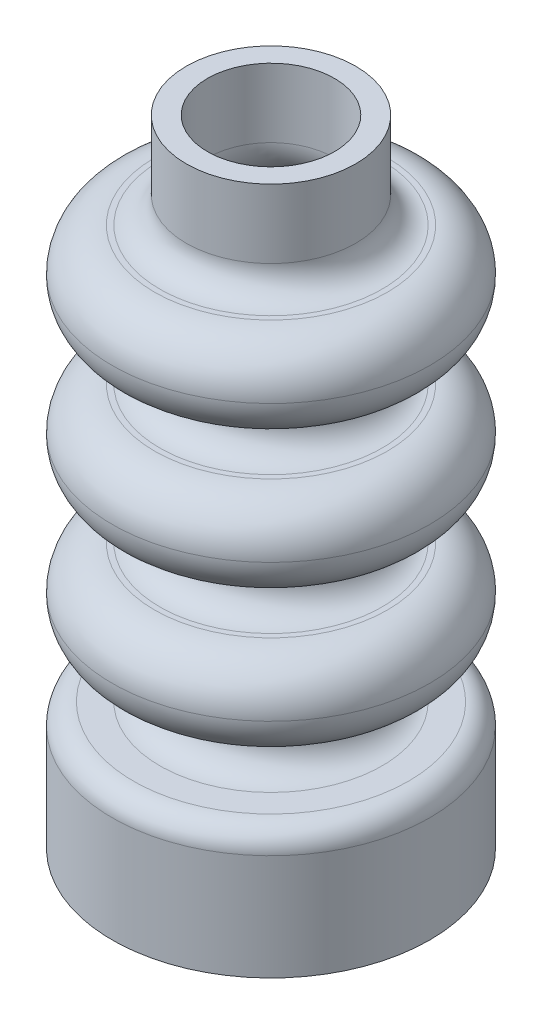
ISO-10303-21;
HEADER;
FILE_DESCRIPTION(('STEP AP214'),'2;1');
FILE_NAME('part.step','',(''),(''),'','','');
FILE_SCHEMA(('AUTOMOTIVE_DESIGN { 1 0 10303 214 1 1 1 1 }'));
ENDSEC;
DATA;
#1=APPLICATION_CONTEXT('core data for automotive mechanical design processes');
#2=APPLICATION_PROTOCOL_DEFINITION('international standard','automotive_design',2000,#1);
#3=PRODUCT_CONTEXT('',#1,'mechanical');
#4=PRODUCT('Part','Part','',(#3));
#5=PRODUCT_RELATED_PRODUCT_CATEGORY('part','',(#4));
#6=PRODUCT_DEFINITION_FORMATION('','',#4);
#7=PRODUCT_DEFINITION_CONTEXT('part definition',#1,'design');
#8=PRODUCT_DEFINITION('design','',#6,#7);
#9=PRODUCT_DEFINITION_SHAPE('','',#8);
#10=(LENGTH_UNIT() NAMED_UNIT(*) SI_UNIT(.MILLI.,.METRE.));
#11=(NAMED_UNIT(*) PLANE_ANGLE_UNIT() SI_UNIT($,.RADIAN.));
#12=(NAMED_UNIT(*) SI_UNIT($,.STERADIAN.) SOLID_ANGLE_UNIT());
#13=UNCERTAINTY_MEASURE_WITH_UNIT(LENGTH_MEASURE(1.E-05),#10,'distance_accuracy_value','');
#14=(GEOMETRIC_REPRESENTATION_CONTEXT(3) GLOBAL_UNCERTAINTY_ASSIGNED_CONTEXT((#13)) GLOBAL_UNIT_ASSIGNED_CONTEXT((#10,
#11,#12)) REPRESENTATION_CONTEXT('',''));
#15=CARTESIAN_POINT('',(0.,0.,0.));
#16=DIRECTION('',(0.,0.,1.));
#17=DIRECTION('',(1.,0.,0.));
#18=AXIS2_PLACEMENT_3D('',#15,#16,#17);
#19=CARTESIAN_POINT('',(0.,0.,0.));
#20=DIRECTION('',(0.,-1.,0.));
#21=DIRECTION('',(1.,0.,0.));
#22=AXIS2_PLACEMENT_3D('',#19,#20,#21);
#23=PLANE('',#22);
#24=CARTESIAN_POINT('',(0.,0.,0.));
#25=DIRECTION('',(0.,-1.,0.));
#26=DIRECTION('',(1.,0.,0.));
#27=AXIS2_PLACEMENT_3D('',#24,#25,#26);
#28=CIRCLE('',#27,3.25);
#29=CARTESIAN_POINT('',(3.25,0.,0.));
#30=VERTEX_POINT('',#29);
#31=EDGE_CURVE('E121',#30,#30,#28,.F.);
#32=ORIENTED_EDGE('',*,*,#31,.T.);
#33=EDGE_LOOP('',(#32));
#34=FACE_BOUND('',#33,.T.);
#35=CARTESIAN_POINT('',(0.,0.,0.));
#36=DIRECTION('',(0.,1.,0.));
#37=DIRECTION('',(-1.,0.,0.));
#38=AXIS2_PLACEMENT_3D('',#35,#36,#37);
#39=CIRCLE('',#38,3.75);
#40=CARTESIAN_POINT('',(-3.75,0.,0.));
#41=VERTEX_POINT('',#40);
#42=EDGE_CURVE('E113',#41,#41,#39,.T.);
#43=ORIENTED_EDGE('',*,*,#42,.F.);
#44=EDGE_LOOP('',(#43));
#45=FACE_BOUND('',#44,.T.);
#46=ADVANCED_FACE('F37',(#34,#45),#23,.T.);
#47=CARTESIAN_POINT('',(0.,15.,0.));
#48=DIRECTION('',(0.,1.,0.));
#49=DIRECTION('',(-1.,0.,0.));
#50=AXIS2_PLACEMENT_3D('',#47,#48,#49);
#51=CYLINDRICAL_SURFACE('',#50,3.75);
#52=CARTESIAN_POINT('',(0.,2.5,0.));
#53=DIRECTION('',(0.,1.,0.));
#54=DIRECTION('',(-1.,0.,0.));
#55=AXIS2_PLACEMENT_3D('',#52,#53,#54);
#56=CIRCLE('',#55,3.75);
#57=CARTESIAN_POINT('',(-3.75,2.5,0.));
#58=VERTEX_POINT('',#57);
#59=EDGE_CURVE('E10',#58,#58,#56,.F.);
#60=ORIENTED_EDGE('',*,*,#59,.T.);
#61=EDGE_LOOP('',(#60));
#62=FACE_BOUND('',#61,.T.);
#63=ORIENTED_EDGE('',*,*,#42,.T.);
#64=EDGE_LOOP('',(#63));
#65=FACE_BOUND('',#64,.T.);
#66=ADVANCED_FACE('F223',(#62,#65),#51,.T.);
#67=CARTESIAN_POINT('',(-3.75,3.,0.));
#68=DIRECTION('',(0.,1.,0.));
#69=DIRECTION('',(-1.,0.,0.));
#70=AXIS2_PLACEMENT_3D('',#67,#68,#69);
#71=PLANE('',#70);
#72=CARTESIAN_POINT('',(0.,3.,0.));
#73=DIRECTION('',(0.,1.,0.));
#74=DIRECTION('',(-1.,0.,0.));
#75=AXIS2_PLACEMENT_3D('',#72,#73,#74);
#76=CIRCLE('',#75,3.25);
#77=CARTESIAN_POINT('',(-3.25,3.,0.));
#78=VERTEX_POINT('',#77);
#79=EDGE_CURVE('E44',#78,#78,#76,.T.);
#80=ORIENTED_EDGE('',*,*,#79,.T.);
#81=EDGE_LOOP('',(#80));
#82=FACE_BOUND('',#81,.T.);
#83=CARTESIAN_POINT('',(0.,3.,0.));
#84=DIRECTION('',(0.,1.,0.));
#85=DIRECTION('',(-1.,0.,0.));
#86=AXIS2_PLACEMENT_3D('',#83,#84,#85);
#87=CIRCLE('',#86,2.625);
#88=CARTESIAN_POINT('',(-2.625,3.,0.));
#89=VERTEX_POINT('',#88);
#90=EDGE_CURVE('E107',#89,#89,#87,.F.);
#91=ORIENTED_EDGE('',*,*,#90,.T.);
#92=EDGE_LOOP('',(#91));
#93=FACE_BOUND('',#92,.T.);
#94=ADVANCED_FACE('F229',(#82,#93),#71,.T.);
#95=CARTESIAN_POINT('',(-2.,4.25,0.));
#96=DIRECTION('',(0.,-1.,0.));
#97=DIRECTION('',(1.,0.,0.));
#98=AXIS2_PLACEMENT_3D('',#95,#96,#97);
#99=PLANE('',#98);
#100=CARTESIAN_POINT('',(0.,4.25,0.));
#101=DIRECTION('',(0.,-1.,0.));
#102=DIRECTION('',(1.,0.,0.));
#103=AXIS2_PLACEMENT_3D('',#100,#101,#102);
#104=CIRCLE('',#103,2.75);
#105=CARTESIAN_POINT('',(2.75,4.25,0.));
#106=VERTEX_POINT('',#105);
#107=EDGE_CURVE('E48',#106,#106,#104,.T.);
#108=ORIENTED_EDGE('',*,*,#107,.T.);
#109=EDGE_LOOP('',(#108));
#110=FACE_BOUND('',#109,.T.);
#111=CARTESIAN_POINT('',(0.,4.25,0.));
#112=DIRECTION('',(0.,-1.,0.));
#113=DIRECTION('',(1.,0.,0.));
#114=AXIS2_PLACEMENT_3D('',#111,#112,#113);
#115=CIRCLE('',#114,2.625);
#116=CARTESIAN_POINT('',(2.625,4.25,0.));
#117=VERTEX_POINT('',#116);
#118=EDGE_CURVE('E110',#117,#117,#115,.F.);
#119=ORIENTED_EDGE('',*,*,#118,.T.);
#120=EDGE_LOOP('',(#119));
#121=FACE_BOUND('',#120,.T.);
#122=ADVANCED_FACE('F299',(#110,#121),#99,.T.);
#123=CARTESIAN_POINT('',(-3.74999999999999,6.25,0.));
#124=DIRECTION('',(0.,1.,0.));
#125=DIRECTION('',(-1.,0.,0.));
#126=AXIS2_PLACEMENT_3D('',#123,#124,#125);
#127=PLANE('',#126);
#128=CARTESIAN_POINT('',(0.,6.25,0.));
#129=DIRECTION('',(0.,1.,0.));
#130=DIRECTION('',(-1.,0.,0.));
#131=AXIS2_PLACEMENT_3D('',#128,#129,#130);
#132=CIRCLE('',#131,2.75);
#133=CARTESIAN_POINT('',(-2.75,6.25,0.));
#134=VERTEX_POINT('',#133);
#135=EDGE_CURVE('E65',#134,#134,#132,.T.);
#136=ORIENTED_EDGE('',*,*,#135,.T.);
#137=EDGE_LOOP('',(#136));
#138=FACE_BOUND('',#137,.T.);
#139=CARTESIAN_POINT('',(0.,6.25,0.));
#140=DIRECTION('',(0.,1.,0.));
#141=DIRECTION('',(-1.,0.,0.));
#142=AXIS2_PLACEMENT_3D('',#139,#140,#141);
#143=CIRCLE('',#142,2.625);
#144=CARTESIAN_POINT('',(-2.625,6.25,0.));
#145=VERTEX_POINT('',#144);
#146=EDGE_CURVE('E101',#145,#145,#143,.F.);
#147=ORIENTED_EDGE('',*,*,#146,.T.);
#148=EDGE_LOOP('',(#147));
#149=FACE_BOUND('',#148,.T.);
#150=ADVANCED_FACE('F295',(#138,#149),#127,.T.);
#151=CARTESIAN_POINT('',(-2.,7.5,0.));
#152=DIRECTION('',(0.,-1.,0.));
#153=DIRECTION('',(1.,0.,0.));
#154=AXIS2_PLACEMENT_3D('',#151,#152,#153);
#155=PLANE('',#154);
#156=CARTESIAN_POINT('',(0.,7.5,0.));
#157=DIRECTION('',(0.,-1.,0.));
#158=DIRECTION('',(1.,0.,0.));
#159=AXIS2_PLACEMENT_3D('',#156,#157,#158);
#160=CIRCLE('',#159,2.75);
#161=CARTESIAN_POINT('',(2.75,7.5,0.));
#162=VERTEX_POINT('',#161);
#163=EDGE_CURVE('E74',#162,#162,#160,.T.);
#164=ORIENTED_EDGE('',*,*,#163,.T.);
#165=EDGE_LOOP('',(#164));
#166=FACE_BOUND('',#165,.T.);
#167=CARTESIAN_POINT('',(0.,7.5,0.));
#168=DIRECTION('',(0.,-1.,0.));
#169=DIRECTION('',(1.,0.,0.));
#170=AXIS2_PLACEMENT_3D('',#167,#168,#169);
#171=CIRCLE('',#170,2.625);
#172=CARTESIAN_POINT('',(2.625,7.5,0.));
#173=VERTEX_POINT('',#172);
#174=EDGE_CURVE('E104',#173,#173,#171,.F.);
#175=ORIENTED_EDGE('',*,*,#174,.T.);
#176=EDGE_LOOP('',(#175));
#177=FACE_BOUND('',#176,.T.);
#178=ADVANCED_FACE('F298',(#166,#177),#155,.T.);
#179=CARTESIAN_POINT('',(-3.75,9.5,0.));
#180=DIRECTION('',(0.,1.,0.));
#181=DIRECTION('',(-1.,0.,0.));
#182=AXIS2_PLACEMENT_3D('',#179,#180,#181);
#183=PLANE('',#182);
#184=CARTESIAN_POINT('',(0.,9.5,0.));
#185=DIRECTION('',(0.,1.,0.));
#186=DIRECTION('',(-1.,0.,0.));
#187=AXIS2_PLACEMENT_3D('',#184,#185,#186);
#188=CIRCLE('',#187,2.75);
#189=CARTESIAN_POINT('',(-2.75,9.5,0.));
#190=VERTEX_POINT('',#189);
#191=EDGE_CURVE('E77',#190,#190,#188,.T.);
#192=ORIENTED_EDGE('',*,*,#191,.T.);
#193=EDGE_LOOP('',(#192));
#194=FACE_BOUND('',#193,.T.);
#195=CARTESIAN_POINT('',(0.,9.5,0.));
#196=DIRECTION('',(0.,1.,0.));
#197=DIRECTION('',(-1.,0.,0.));
#198=AXIS2_PLACEMENT_3D('',#195,#196,#197);
#199=CIRCLE('',#198,2.625);
#200=CARTESIAN_POINT('',(-2.625,9.5,0.));
#201=VERTEX_POINT('',#200);
#202=EDGE_CURVE('E95',#201,#201,#199,.F.);
#203=ORIENTED_EDGE('',*,*,#202,.T.);
#204=EDGE_LOOP('',(#203));
#205=FACE_BOUND('',#204,.T.);
#206=ADVANCED_FACE('F308',(#194,#205),#183,.T.);
#207=CARTESIAN_POINT('',(-2.,10.75,0.));
#208=DIRECTION('',(0.,-1.,0.));
#209=DIRECTION('',(1.,0.,0.));
#210=AXIS2_PLACEMENT_3D('',#207,#208,#209);
#211=PLANE('',#210);
#212=CARTESIAN_POINT('',(0.,10.75,0.));
#213=DIRECTION('',(0.,-1.,0.));
#214=DIRECTION('',(1.,0.,0.));
#215=AXIS2_PLACEMENT_3D('',#212,#213,#214);
#216=CIRCLE('',#215,2.75);
#217=CARTESIAN_POINT('',(2.75,10.75,0.));
#218=VERTEX_POINT('',#217);
#219=EDGE_CURVE('E68',#218,#218,#216,.T.);
#220=ORIENTED_EDGE('',*,*,#219,.T.);
#221=EDGE_LOOP('',(#220));
#222=FACE_BOUND('',#221,.T.);
#223=CARTESIAN_POINT('',(0.,10.75,0.));
#224=DIRECTION('',(0.,-1.,0.));
#225=DIRECTION('',(1.,0.,0.));
#226=AXIS2_PLACEMENT_3D('',#223,#224,#225);
#227=CIRCLE('',#226,2.625);
#228=CARTESIAN_POINT('',(2.625,10.75,0.));
#229=VERTEX_POINT('',#228);
#230=EDGE_CURVE('E98',#229,#229,#227,.F.);
#231=ORIENTED_EDGE('',*,*,#230,.T.);
#232=EDGE_LOOP('',(#231));
#233=FACE_BOUND('',#232,.T.);
#234=ADVANCED_FACE('F314',(#222,#233),#211,.T.);
#235=CARTESIAN_POINT('',(-3.75,12.75,0.));
#236=DIRECTION('',(0.,1.,0.));
#237=DIRECTION('',(-1.,0.,0.));
#238=AXIS2_PLACEMENT_3D('',#235,#236,#237);
#239=PLANE('',#238);
#240=CARTESIAN_POINT('',(0.,12.75,0.));
#241=DIRECTION('',(0.,1.,0.));
#242=DIRECTION('',(-1.,0.,0.));
#243=AXIS2_PLACEMENT_3D('',#240,#241,#242);
#244=CIRCLE('',#243,2.75);
#245=CARTESIAN_POINT('',(-2.75,12.75,0.));
#246=VERTEX_POINT('',#245);
#247=EDGE_CURVE('E71',#246,#246,#244,.T.);
#248=ORIENTED_EDGE('',*,*,#247,.T.);
#249=EDGE_LOOP('',(#248));
#250=FACE_BOUND('',#249,.T.);
#251=CARTESIAN_POINT('',(0.,12.75,0.));
#252=DIRECTION('',(0.,1.,0.));
#253=DIRECTION('',(-1.,0.,0.));
#254=AXIS2_PLACEMENT_3D('',#251,#252,#253);
#255=CIRCLE('',#254,2.625);
#256=CARTESIAN_POINT('',(-2.625,12.75,0.));
#257=VERTEX_POINT('',#256);
#258=EDGE_CURVE('E80',#257,#257,#255,.F.);
#259=ORIENTED_EDGE('',*,*,#258,.T.);
#260=EDGE_LOOP('',(#259));
#261=FACE_BOUND('',#260,.T.);
#262=ADVANCED_FACE('F366',(#250,#261),#239,.T.);
#263=CARTESIAN_POINT('',(0.,15.,0.));
#264=DIRECTION('',(0.,1.,0.));
#265=DIRECTION('',(-1.,0.,0.));
#266=AXIS2_PLACEMENT_3D('',#263,#264,#265);
#267=CYLINDRICAL_SURFACE('',#266,2.);
#268=CARTESIAN_POINT('',(0.,13.375,0.));
#269=DIRECTION('',(0.,1.,0.));
#270=DIRECTION('',(-1.,0.,0.));
#271=AXIS2_PLACEMENT_3D('',#268,#269,#270);
#272=CIRCLE('',#271,2.);
#273=CARTESIAN_POINT('',(-2.,13.375,0.));
#274=VERTEX_POINT('',#273);
#275=EDGE_CURVE('E92',#274,#274,#272,.T.);
#276=ORIENTED_EDGE('',*,*,#275,.T.);
#277=EDGE_LOOP('',(#276));
#278=FACE_BOUND('',#277,.T.);
#279=CARTESIAN_POINT('',(0.,15.,0.));
#280=DIRECTION('',(0.,1.,0.));
#281=DIRECTION('',(-1.,0.,0.));
#282=AXIS2_PLACEMENT_3D('',#279,#280,#281);
#283=CIRCLE('',#282,2.);
#284=CARTESIAN_POINT('',(-2.,15.,0.));
#285=VERTEX_POINT('',#284);
#286=EDGE_CURVE('E89',#285,#285,#283,.T.);
#287=ORIENTED_EDGE('',*,*,#286,.F.);
#288=EDGE_LOOP('',(#287));
#289=FACE_BOUND('',#288,.T.);
#290=ADVANCED_FACE('F375',(#278,#289),#267,.T.);
#291=CARTESIAN_POINT('',(-2.,15.,0.));
#292=DIRECTION('',(0.,1.,0.));
#293=DIRECTION('',(-1.,0.,0.));
#294=AXIS2_PLACEMENT_3D('',#291,#292,#293);
#295=PLANE('',#294);
#296=CARTESIAN_POINT('',(0.,15.,0.));
#297=DIRECTION('',(0.,1.,0.));
#298=DIRECTION('',(-1.,0.,0.));
#299=AXIS2_PLACEMENT_3D('',#296,#297,#298);
#300=CIRCLE('',#299,1.5);
#301=CARTESIAN_POINT('',(-1.5,15.,0.));
#302=VERTEX_POINT('',#301);
#303=EDGE_CURVE('E118',#302,#302,#300,.T.);
#304=ORIENTED_EDGE('',*,*,#303,.F.);
#305=EDGE_LOOP('',(#304));
#306=FACE_BOUND('',#305,.T.);
#307=ORIENTED_EDGE('',*,*,#286,.T.);
#308=EDGE_LOOP('',(#307));
#309=FACE_BOUND('',#308,.T.);
#310=ADVANCED_FACE('F242',(#306,#309),#295,.T.);
#311=CARTESIAN_POINT('',(0.,3.625,0.));
#312=DIRECTION('',(0.,1.,0.));
#313=DIRECTION('',(-1.,0.,0.));
#314=AXIS2_PLACEMENT_3D('',#311,#312,#313);
#315=TOROIDAL_SURFACE('',#314,2.625,0.625);
#316=ORIENTED_EDGE('',*,*,#90,.F.);
#317=EDGE_LOOP('',(#316));
#318=FACE_BOUND('',#317,.T.);
#319=CARTESIAN_POINT('',(0.,3.625,0.));
#320=DIRECTION('',(0.,1.,0.));
#321=DIRECTION('',(-1.,0.,0.));
#322=AXIS2_PLACEMENT_3D('',#319,#320,#321);
#323=CIRCLE('',#322,2.);
#324=CARTESIAN_POINT('',(-2.,3.625,0.));
#325=VERTEX_POINT('',#324);
#326=EDGE_CURVE('E86',#325,#325,#323,.T.);
#327=ORIENTED_EDGE('',*,*,#326,.F.);
#328=EDGE_LOOP('',(#327));
#329=FACE_BOUND('',#328,.T.);
#330=ADVANCED_FACE('F238',(#318,#329),#315,.F.);
#331=CARTESIAN_POINT('',(0.,3.625,0.));
#332=DIRECTION('',(0.,-1.,0.));
#333=DIRECTION('',(1.,0.,0.));
#334=AXIS2_PLACEMENT_3D('',#331,#332,#333);
#335=TOROIDAL_SURFACE('',#334,2.625,0.625);
#336=ORIENTED_EDGE('',*,*,#326,.T.);
#337=EDGE_LOOP('',(#336));
#338=FACE_BOUND('',#337,.T.);
#339=ORIENTED_EDGE('',*,*,#118,.F.);
#340=EDGE_LOOP('',(#339));
#341=FACE_BOUND('',#340,.T.);
#342=ADVANCED_FACE('F234',(#338,#341),#335,.F.);
#343=CARTESIAN_POINT('',(0.,6.875,0.));
#344=DIRECTION('',(0.,1.,0.));
#345=DIRECTION('',(-1.,0.,0.));
#346=AXIS2_PLACEMENT_3D('',#343,#344,#345);
#347=TOROIDAL_SURFACE('',#346,2.625,0.625);
#348=ORIENTED_EDGE('',*,*,#146,.F.);
#349=EDGE_LOOP('',(#348));
#350=FACE_BOUND('',#349,.T.);
#351=CARTESIAN_POINT('',(0.,6.875,0.));
#352=DIRECTION('',(0.,1.,0.));
#353=DIRECTION('',(-1.,0.,0.));
#354=AXIS2_PLACEMENT_3D('',#351,#352,#353);
#355=CIRCLE('',#354,2.);
#356=CARTESIAN_POINT('',(-2.,6.875,0.));
#357=VERTEX_POINT('',#356);
#358=EDGE_CURVE('E83',#357,#357,#355,.T.);
#359=ORIENTED_EDGE('',*,*,#358,.F.);
#360=EDGE_LOOP('',(#359));
#361=FACE_BOUND('',#360,.T.);
#362=ADVANCED_FACE('F237',(#350,#361),#347,.F.);
#363=CARTESIAN_POINT('',(0.,6.875,0.));
#364=DIRECTION('',(0.,-1.,0.));
#365=DIRECTION('',(1.,0.,0.));
#366=AXIS2_PLACEMENT_3D('',#363,#364,#365);
#367=TOROIDAL_SURFACE('',#366,2.625,0.625);
#368=ORIENTED_EDGE('',*,*,#358,.T.);
#369=EDGE_LOOP('',(#368));
#370=FACE_BOUND('',#369,.T.);
#371=ORIENTED_EDGE('',*,*,#174,.F.);
#372=EDGE_LOOP('',(#371));
#373=FACE_BOUND('',#372,.T.);
#374=ADVANCED_FACE('F244',(#370,#373),#367,.F.);
#375=CARTESIAN_POINT('',(0.,10.125,0.));
#376=DIRECTION('',(0.,1.,0.));
#377=DIRECTION('',(-1.,0.,0.));
#378=AXIS2_PLACEMENT_3D('',#375,#376,#377);
#379=TOROIDAL_SURFACE('',#378,2.625,0.625);
#380=ORIENTED_EDGE('',*,*,#202,.F.);
#381=EDGE_LOOP('',(#380));
#382=FACE_BOUND('',#381,.T.);
#383=CARTESIAN_POINT('',(0.,10.125,0.));
#384=DIRECTION('',(0.,1.,0.));
#385=DIRECTION('',(-1.,0.,0.));
#386=AXIS2_PLACEMENT_3D('',#383,#384,#385);
#387=CIRCLE('',#386,2.);
#388=CARTESIAN_POINT('',(-2.,10.125,0.));
#389=VERTEX_POINT('',#388);
#390=EDGE_CURVE('E62',#389,#389,#387,.T.);
#391=ORIENTED_EDGE('',*,*,#390,.F.);
#392=EDGE_LOOP('',(#391));
#393=FACE_BOUND('',#392,.T.);
#394=ADVANCED_FACE('F247',(#382,#393),#379,.F.);
#395=CARTESIAN_POINT('',(0.,10.125,0.));
#396=DIRECTION('',(0.,-1.,0.));
#397=DIRECTION('',(1.,0.,0.));
#398=AXIS2_PLACEMENT_3D('',#395,#396,#397);
#399=TOROIDAL_SURFACE('',#398,2.625,0.625);
#400=ORIENTED_EDGE('',*,*,#390,.T.);
#401=EDGE_LOOP('',(#400));
#402=FACE_BOUND('',#401,.T.);
#403=ORIENTED_EDGE('',*,*,#230,.F.);
#404=EDGE_LOOP('',(#403));
#405=FACE_BOUND('',#404,.T.);
#406=ADVANCED_FACE('F252',(#402,#405),#399,.F.);
#407=CARTESIAN_POINT('',(0.,13.375,0.));
#408=DIRECTION('',(0.,1.,0.));
#409=DIRECTION('',(-1.,0.,0.));
#410=AXIS2_PLACEMENT_3D('',#407,#408,#409);
#411=TOROIDAL_SURFACE('',#410,2.625,0.625);
#412=ORIENTED_EDGE('',*,*,#258,.F.);
#413=EDGE_LOOP('',(#412));
#414=FACE_BOUND('',#413,.T.);
#415=ORIENTED_EDGE('',*,*,#275,.F.);
#416=EDGE_LOOP('',(#415));
#417=FACE_BOUND('',#416,.T.);
#418=ADVANCED_FACE('F255',(#414,#417),#411,.F.);
#419=CARTESIAN_POINT('',(0.,8.5,0.));
#420=DIRECTION('',(0.,-1.,0.));
#421=DIRECTION('',(1.,0.,0.));
#422=AXIS2_PLACEMENT_3D('',#419,#420,#421);
#423=TOROIDAL_SURFACE('',#422,2.75,1.);
#424=ORIENTED_EDGE('',*,*,#163,.F.);
#425=EDGE_LOOP('',(#424));
#426=FACE_BOUND('',#425,.T.);
#427=CARTESIAN_POINT('',(0.,8.5,0.));
#428=DIRECTION('',(0.,-1.,0.));
#429=DIRECTION('',(1.,0.,0.));
#430=AXIS2_PLACEMENT_3D('',#427,#428,#429);
#431=CIRCLE('',#430,3.75);
#432=CARTESIAN_POINT('',(3.75,8.5,0.));
#433=VERTEX_POINT('',#432);
#434=EDGE_CURVE('E58',#433,#433,#431,.F.);
#435=ORIENTED_EDGE('',*,*,#434,.F.);
#436=EDGE_LOOP('',(#435));
#437=FACE_BOUND('',#436,.T.);
#438=ADVANCED_FACE('F262',(#426,#437),#423,.T.);
#439=CARTESIAN_POINT('',(0.,8.5,0.));
#440=DIRECTION('',(0.,1.,0.));
#441=DIRECTION('',(-1.,0.,0.));
#442=AXIS2_PLACEMENT_3D('',#439,#440,#441);
#443=TOROIDAL_SURFACE('',#442,2.75,1.);
#444=ORIENTED_EDGE('',*,*,#434,.T.);
#445=EDGE_LOOP('',(#444));
#446=FACE_BOUND('',#445,.T.);
#447=ORIENTED_EDGE('',*,*,#191,.F.);
#448=EDGE_LOOP('',(#447));
#449=FACE_BOUND('',#448,.T.);
#450=ADVANCED_FACE('F264',(#446,#449),#443,.T.);
#451=CARTESIAN_POINT('',(0.,11.75,0.));
#452=DIRECTION('',(0.,-1.,0.));
#453=DIRECTION('',(1.,0.,0.));
#454=AXIS2_PLACEMENT_3D('',#451,#452,#453);
#455=TOROIDAL_SURFACE('',#454,2.75,1.);
#456=ORIENTED_EDGE('',*,*,#219,.F.);
#457=EDGE_LOOP('',(#456));
#458=FACE_BOUND('',#457,.T.);
#459=CARTESIAN_POINT('',(0.,11.75,0.));
#460=DIRECTION('',(0.,-1.,0.));
#461=DIRECTION('',(1.,0.,0.));
#462=AXIS2_PLACEMENT_3D('',#459,#460,#461);
#463=CIRCLE('',#462,3.75);
#464=CARTESIAN_POINT('',(3.75,11.75,0.));
#465=VERTEX_POINT('',#464);
#466=EDGE_CURVE('E55',#465,#465,#463,.F.);
#467=ORIENTED_EDGE('',*,*,#466,.F.);
#468=EDGE_LOOP('',(#467));
#469=FACE_BOUND('',#468,.T.);
#470=ADVANCED_FACE('F267',(#458,#469),#455,.T.);
#471=CARTESIAN_POINT('',(0.,11.75,0.));
#472=DIRECTION('',(0.,1.,0.));
#473=DIRECTION('',(-1.,0.,0.));
#474=AXIS2_PLACEMENT_3D('',#471,#472,#473);
#475=TOROIDAL_SURFACE('',#474,2.75,1.);
#476=ORIENTED_EDGE('',*,*,#466,.T.);
#477=EDGE_LOOP('',(#476));
#478=FACE_BOUND('',#477,.T.);
#479=ORIENTED_EDGE('',*,*,#247,.F.);
#480=EDGE_LOOP('',(#479));
#481=FACE_BOUND('',#480,.T.);
#482=ADVANCED_FACE('F272',(#478,#481),#475,.T.);
#483=CARTESIAN_POINT('',(0.,5.25,0.));
#484=DIRECTION('',(0.,1.,0.));
#485=DIRECTION('',(-1.,0.,0.));
#486=AXIS2_PLACEMENT_3D('',#483,#484,#485);
#487=TOROIDAL_SURFACE('',#486,2.75,1.);
#488=CARTESIAN_POINT('',(0.,5.25,0.));
#489=DIRECTION('',(0.,1.,0.));
#490=DIRECTION('',(-1.,0.,0.));
#491=AXIS2_PLACEMENT_3D('',#488,#489,#490);
#492=CIRCLE('',#491,3.75);
#493=CARTESIAN_POINT('',(-3.75,5.25,0.));
#494=VERTEX_POINT('',#493);
#495=EDGE_CURVE('E52',#494,#494,#492,.F.);
#496=ORIENTED_EDGE('',*,*,#495,.F.);
#497=EDGE_LOOP('',(#496));
#498=FACE_BOUND('',#497,.T.);
#499=ORIENTED_EDGE('',*,*,#135,.F.);
#500=EDGE_LOOP('',(#499));
#501=FACE_BOUND('',#500,.T.);
#502=ADVANCED_FACE('F275',(#498,#501),#487,.T.);
#503=CARTESIAN_POINT('',(0.,5.25,0.));
#504=DIRECTION('',(0.,-1.,0.));
#505=DIRECTION('',(1.,0.,0.));
#506=AXIS2_PLACEMENT_3D('',#503,#504,#505);
#507=TOROIDAL_SURFACE('',#506,2.75,1.);
#508=ORIENTED_EDGE('',*,*,#107,.F.);
#509=EDGE_LOOP('',(#508));
#510=FACE_BOUND('',#509,.T.);
#511=ORIENTED_EDGE('',*,*,#495,.T.);
#512=EDGE_LOOP('',(#511));
#513=FACE_BOUND('',#512,.T.);
#514=ADVANCED_FACE('F281',(#510,#513),#507,.T.);
#515=CARTESIAN_POINT('',(0.,2.5,0.));
#516=DIRECTION('',(0.,1.,0.));
#517=DIRECTION('',(-1.,0.,0.));
#518=AXIS2_PLACEMENT_3D('',#515,#516,#517);
#519=TOROIDAL_SURFACE('',#518,3.25,0.5);
#520=ORIENTED_EDGE('',*,*,#59,.F.);
#521=EDGE_LOOP('',(#520));
#522=FACE_BOUND('',#521,.T.);
#523=ORIENTED_EDGE('',*,*,#79,.F.);
#524=EDGE_LOOP('',(#523));
#525=FACE_BOUND('',#524,.T.);
#526=ADVANCED_FACE('F39',(#522,#525),#519,.T.);
#527=CARTESIAN_POINT('',(0.,15.,0.));
#528=DIRECTION('',(0.,1.,0.));
#529=DIRECTION('',(-1.,0.,0.));
#530=AXIS2_PLACEMENT_3D('',#527,#528,#529);
#531=CYLINDRICAL_SURFACE('',#530,3.25);
#532=CARTESIAN_POINT('',(0.,2.5,0.));
#533=DIRECTION('',(0.,1.,0.));
#534=DIRECTION('',(-1.,0.,0.));
#535=AXIS2_PLACEMENT_3D('',#532,#533,#534);
#536=CIRCLE('',#535,3.25);
#537=CARTESIAN_POINT('',(-3.25,2.5,0.));
#538=VERTEX_POINT('',#537);
#539=EDGE_CURVE('E59',#538,#538,#536,.T.);
#540=ORIENTED_EDGE('',*,*,#539,.T.);
#541=EDGE_LOOP('',(#540));
#542=FACE_BOUND('',#541,.T.);
#543=ORIENTED_EDGE('',*,*,#31,.F.);
#544=EDGE_LOOP('',(#543));
#545=FACE_BOUND('',#544,.T.);
#546=ADVANCED_FACE('F187',(#542,#545),#531,.F.);
#547=CARTESIAN_POINT('',(-3.75,2.5,0.));
#548=DIRECTION('',(0.,1.,0.));
#549=DIRECTION('',(-1.,0.,0.));
#550=AXIS2_PLACEMENT_3D('',#547,#548,#549);
#551=PLANE('',#550);
#552=ORIENTED_EDGE('',*,*,#539,.F.);
#553=EDGE_LOOP('',(#552));
#554=FACE_BOUND('',#553,.T.);
#555=CARTESIAN_POINT('',(0.,2.5,0.));
#556=DIRECTION('',(0.,1.,0.));
#557=DIRECTION('',(-1.,0.,0.));
#558=AXIS2_PLACEMENT_3D('',#555,#556,#557);
#559=CIRCLE('',#558,2.625);
#560=CARTESIAN_POINT('',(-2.625,2.5,0.));
#561=VERTEX_POINT('',#560);
#562=EDGE_CURVE('E165',#561,#561,#559,.F.);
#563=ORIENTED_EDGE('',*,*,#562,.F.);
#564=EDGE_LOOP('',(#563));
#565=FACE_BOUND('',#564,.T.);
#566=ADVANCED_FACE('F190',(#554,#565),#551,.F.);
#567=CARTESIAN_POINT('',(-2.,4.75,0.));
#568=DIRECTION('',(0.,-1.,0.));
#569=DIRECTION('',(1.,0.,0.));
#570=AXIS2_PLACEMENT_3D('',#567,#568,#569);
#571=PLANE('',#570);
#572=CARTESIAN_POINT('',(0.,4.75,0.));
#573=DIRECTION('',(0.,-1.,0.));
#574=DIRECTION('',(1.,0.,0.));
#575=AXIS2_PLACEMENT_3D('',#572,#573,#574);
#576=CIRCLE('',#575,2.75);
#577=CARTESIAN_POINT('',(2.75,4.75,0.));
#578=VERTEX_POINT('',#577);
#579=EDGE_CURVE('E175',#578,#578,#576,.T.);
#580=ORIENTED_EDGE('',*,*,#579,.F.);
#581=EDGE_LOOP('',(#580));
#582=FACE_BOUND('',#581,.T.);
#583=CARTESIAN_POINT('',(0.,4.75,0.));
#584=DIRECTION('',(0.,-1.,0.));
#585=DIRECTION('',(1.,0.,0.));
#586=AXIS2_PLACEMENT_3D('',#583,#584,#585);
#587=CIRCLE('',#586,2.625);
#588=CARTESIAN_POINT('',(2.625,4.75,0.));
#589=VERTEX_POINT('',#588);
#590=EDGE_CURVE('E125',#589,#589,#587,.F.);
#591=ORIENTED_EDGE('',*,*,#590,.F.);
#592=EDGE_LOOP('',(#591));
#593=FACE_BOUND('',#592,.T.);
#594=ADVANCED_FACE('F193',(#582,#593),#571,.F.);
#595=CARTESIAN_POINT('',(-3.74999999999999,5.75,0.));
#596=DIRECTION('',(0.,1.,0.));
#597=DIRECTION('',(-1.,0.,0.));
#598=AXIS2_PLACEMENT_3D('',#595,#596,#597);
#599=PLANE('',#598);
#600=CARTESIAN_POINT('',(0.,5.75,0.));
#601=DIRECTION('',(0.,1.,0.));
#602=DIRECTION('',(-1.,0.,0.));
#603=AXIS2_PLACEMENT_3D('',#600,#601,#602);
#604=CIRCLE('',#603,2.75);
#605=CARTESIAN_POINT('',(-2.75,5.75,0.));
#606=VERTEX_POINT('',#605);
#607=EDGE_CURVE('E145',#606,#606,#604,.T.);
#608=ORIENTED_EDGE('',*,*,#607,.F.);
#609=EDGE_LOOP('',(#608));
#610=FACE_BOUND('',#609,.T.);
#611=CARTESIAN_POINT('',(0.,5.75,0.));
#612=DIRECTION('',(0.,1.,0.));
#613=DIRECTION('',(-1.,0.,0.));
#614=AXIS2_PLACEMENT_3D('',#611,#612,#613);
#615=CIRCLE('',#614,2.625);
#616=CARTESIAN_POINT('',(-2.625,5.75,0.));
#617=VERTEX_POINT('',#616);
#618=EDGE_CURVE('E149',#617,#617,#615,.F.);
#619=ORIENTED_EDGE('',*,*,#618,.F.);
#620=EDGE_LOOP('',(#619));
#621=FACE_BOUND('',#620,.T.);
#622=ADVANCED_FACE('F212',(#610,#621),#599,.F.);
#623=CARTESIAN_POINT('',(-2.,8.,0.));
#624=DIRECTION('',(0.,-1.,0.));
#625=DIRECTION('',(1.,0.,0.));
#626=AXIS2_PLACEMENT_3D('',#623,#624,#625);
#627=PLANE('',#626);
#628=CARTESIAN_POINT('',(0.,8.,0.));
#629=DIRECTION('',(0.,-1.,0.));
#630=DIRECTION('',(1.,0.,0.));
#631=AXIS2_PLACEMENT_3D('',#628,#629,#630);
#632=CIRCLE('',#631,2.75);
#633=CARTESIAN_POINT('',(2.75,8.,0.));
#634=VERTEX_POINT('',#633);
#635=EDGE_CURVE('E138',#634,#634,#632,.T.);
#636=ORIENTED_EDGE('',*,*,#635,.F.);
#637=EDGE_LOOP('',(#636));
#638=FACE_BOUND('',#637,.T.);
#639=CARTESIAN_POINT('',(0.,8.,0.));
#640=DIRECTION('',(0.,-1.,0.));
#641=DIRECTION('',(1.,0.,0.));
#642=AXIS2_PLACEMENT_3D('',#639,#640,#641);
#643=CIRCLE('',#642,2.625);
#644=CARTESIAN_POINT('',(2.625,8.,0.));
#645=VERTEX_POINT('',#644);
#646=EDGE_CURVE('E162',#645,#645,#643,.F.);
#647=ORIENTED_EDGE('',*,*,#646,.F.);
#648=EDGE_LOOP('',(#647));
#649=FACE_BOUND('',#648,.T.);
#650=ADVANCED_FACE('F218',(#638,#649),#627,.F.);
#651=CARTESIAN_POINT('',(-3.75,9.,0.));
#652=DIRECTION('',(0.,1.,0.));
#653=DIRECTION('',(-1.,0.,0.));
#654=AXIS2_PLACEMENT_3D('',#651,#652,#653);
#655=PLANE('',#654);
#656=CARTESIAN_POINT('',(0.,9.,0.));
#657=DIRECTION('',(0.,1.,0.));
#658=DIRECTION('',(-1.,0.,0.));
#659=AXIS2_PLACEMENT_3D('',#656,#657,#658);
#660=CIRCLE('',#659,2.75);
#661=CARTESIAN_POINT('',(-2.75,9.,0.));
#662=VERTEX_POINT('',#661);
#663=EDGE_CURVE('E133',#662,#662,#660,.T.);
#664=ORIENTED_EDGE('',*,*,#663,.F.);
#665=EDGE_LOOP('',(#664));
#666=FACE_BOUND('',#665,.T.);
#667=CARTESIAN_POINT('',(0.,9.,0.));
#668=DIRECTION('',(0.,1.,0.));
#669=DIRECTION('',(-1.,0.,0.));
#670=AXIS2_PLACEMENT_3D('',#667,#668,#669);
#671=CIRCLE('',#670,2.625);
#672=CARTESIAN_POINT('',(-2.625,9.,0.));
#673=VERTEX_POINT('',#672);
#674=EDGE_CURVE('E130',#673,#673,#671,.F.);
#675=ORIENTED_EDGE('',*,*,#674,.F.);
#676=EDGE_LOOP('',(#675));
#677=FACE_BOUND('',#676,.T.);
#678=ADVANCED_FACE('F448',(#666,#677),#655,.F.);
#679=CARTESIAN_POINT('',(-2.,11.25,0.));
#680=DIRECTION('',(0.,-1.,0.));
#681=DIRECTION('',(1.,0.,0.));
#682=AXIS2_PLACEMENT_3D('',#679,#680,#681);
#683=PLANE('',#682);
#684=CARTESIAN_POINT('',(0.,11.25,0.));
#685=DIRECTION('',(0.,-1.,0.));
#686=DIRECTION('',(1.,0.,0.));
#687=AXIS2_PLACEMENT_3D('',#684,#685,#686);
#688=CIRCLE('',#687,2.75);
#689=CARTESIAN_POINT('',(2.75,11.25,0.));
#690=VERTEX_POINT('',#689);
#691=EDGE_CURVE('E137',#690,#690,#688,.T.);
#692=ORIENTED_EDGE('',*,*,#691,.F.);
#693=EDGE_LOOP('',(#692));
#694=FACE_BOUND('',#693,.T.);
#695=CARTESIAN_POINT('',(0.,11.25,0.));
#696=DIRECTION('',(0.,-1.,0.));
#697=DIRECTION('',(1.,0.,0.));
#698=AXIS2_PLACEMENT_3D('',#695,#696,#697);
#699=CIRCLE('',#698,2.625);
#700=CARTESIAN_POINT('',(2.625,11.25,0.));
#701=VERTEX_POINT('',#700);
#702=EDGE_CURVE('E146',#701,#701,#699,.F.);
#703=ORIENTED_EDGE('',*,*,#702,.F.);
#704=EDGE_LOOP('',(#703));
#705=FACE_BOUND('',#704,.T.);
#706=ADVANCED_FACE('F457',(#694,#705),#683,.F.);
#707=CARTESIAN_POINT('',(-3.75,12.25,0.));
#708=DIRECTION('',(0.,1.,0.));
#709=DIRECTION('',(-1.,0.,0.));
#710=AXIS2_PLACEMENT_3D('',#707,#708,#709);
#711=PLANE('',#710);
#712=CARTESIAN_POINT('',(0.,12.25,0.));
#713=DIRECTION('',(0.,1.,0.));
#714=DIRECTION('',(-1.,0.,0.));
#715=AXIS2_PLACEMENT_3D('',#712,#713,#714);
#716=CIRCLE('',#715,2.75);
#717=CARTESIAN_POINT('',(-2.75,12.25,0.));
#718=VERTEX_POINT('',#717);
#719=EDGE_CURVE('E134',#718,#718,#716,.T.);
#720=ORIENTED_EDGE('',*,*,#719,.F.);
#721=EDGE_LOOP('',(#720));
#722=FACE_BOUND('',#721,.T.);
#723=CARTESIAN_POINT('',(0.,12.25,0.));
#724=DIRECTION('',(0.,1.,0.));
#725=DIRECTION('',(-1.,0.,0.));
#726=AXIS2_PLACEMENT_3D('',#723,#724,#725);
#727=CIRCLE('',#726,2.625);
#728=CARTESIAN_POINT('',(-2.625,12.25,0.));
#729=VERTEX_POINT('',#728);
#730=EDGE_CURVE('E129',#729,#729,#727,.F.);
#731=ORIENTED_EDGE('',*,*,#730,.F.);
#732=EDGE_LOOP('',(#731));
#733=FACE_BOUND('',#732,.T.);
#734=ADVANCED_FACE('F466',(#722,#733),#711,.F.);
#735=CARTESIAN_POINT('',(0.,15.,0.));
#736=DIRECTION('',(0.,1.,0.));
#737=DIRECTION('',(-1.,0.,0.));
#738=AXIS2_PLACEMENT_3D('',#735,#736,#737);
#739=CYLINDRICAL_SURFACE('',#738,1.5);
#740=CARTESIAN_POINT('',(0.,13.375,0.));
#741=DIRECTION('',(0.,1.,0.));
#742=DIRECTION('',(-1.,0.,0.));
#743=AXIS2_PLACEMENT_3D('',#740,#741,#742);
#744=CIRCLE('',#743,1.5);
#745=CARTESIAN_POINT('',(-1.5,13.375,0.));
#746=VERTEX_POINT('',#745);
#747=EDGE_CURVE('E126',#746,#746,#744,.T.);
#748=ORIENTED_EDGE('',*,*,#747,.F.);
#749=EDGE_LOOP('',(#748));
#750=FACE_BOUND('',#749,.T.);
#751=ORIENTED_EDGE('',*,*,#303,.T.);
#752=EDGE_LOOP('',(#751));
#753=FACE_BOUND('',#752,.T.);
#754=ADVANCED_FACE('F201',(#750,#753),#739,.F.);
#755=CARTESIAN_POINT('',(0.,3.625,0.));
#756=DIRECTION('',(0.,1.,0.));
#757=DIRECTION('',(-1.,0.,0.));
#758=AXIS2_PLACEMENT_3D('',#755,#756,#757);
#759=TOROIDAL_SURFACE('',#758,2.625,1.125);
#760=ORIENTED_EDGE('',*,*,#562,.T.);
#761=EDGE_LOOP('',(#760));
#762=FACE_BOUND('',#761,.T.);
#763=CARTESIAN_POINT('',(0.,3.625,0.));
#764=DIRECTION('',(0.,-1.,0.));
#765=DIRECTION('',(1.,0.,0.));
#766=AXIS2_PLACEMENT_3D('',#763,#764,#765);
#767=CIRCLE('',#766,1.5);
#768=CARTESIAN_POINT('',(1.5,3.625,0.));
#769=VERTEX_POINT('',#768);
#770=EDGE_CURVE('E122',#769,#769,#767,.F.);
#771=ORIENTED_EDGE('',*,*,#770,.T.);
#772=EDGE_LOOP('',(#771));
#773=FACE_BOUND('',#772,.T.);
#774=ADVANCED_FACE('F197',(#762,#773),#759,.T.);
#775=CARTESIAN_POINT('',(0.,3.625,0.));
#776=DIRECTION('',(0.,-1.,0.));
#777=DIRECTION('',(1.,0.,0.));
#778=AXIS2_PLACEMENT_3D('',#775,#776,#777);
#779=TOROIDAL_SURFACE('',#778,2.625,1.125);
#780=ORIENTED_EDGE('',*,*,#770,.F.);
#781=EDGE_LOOP('',(#780));
#782=FACE_BOUND('',#781,.T.);
#783=ORIENTED_EDGE('',*,*,#590,.T.);
#784=EDGE_LOOP('',(#783));
#785=FACE_BOUND('',#784,.T.);
#786=ADVANCED_FACE('F200',(#782,#785),#779,.T.);
#787=CARTESIAN_POINT('',(0.,6.875,0.));
#788=DIRECTION('',(0.,1.,0.));
#789=DIRECTION('',(-1.,0.,0.));
#790=AXIS2_PLACEMENT_3D('',#787,#788,#789);
#791=TOROIDAL_SURFACE('',#790,2.625,1.125);
#792=ORIENTED_EDGE('',*,*,#618,.T.);
#793=EDGE_LOOP('',(#792));
#794=FACE_BOUND('',#793,.T.);
#795=CARTESIAN_POINT('',(0.,6.875,0.));
#796=DIRECTION('',(0.,-1.,0.));
#797=DIRECTION('',(1.,0.,0.));
#798=AXIS2_PLACEMENT_3D('',#795,#796,#797);
#799=CIRCLE('',#798,1.5);
#800=CARTESIAN_POINT('',(1.5,6.875,0.));
#801=VERTEX_POINT('',#800);
#802=EDGE_CURVE('E153',#801,#801,#799,.F.);
#803=ORIENTED_EDGE('',*,*,#802,.T.);
#804=EDGE_LOOP('',(#803));
#805=FACE_BOUND('',#804,.T.);
#806=ADVANCED_FACE('F207',(#794,#805),#791,.T.);
#807=CARTESIAN_POINT('',(0.,6.875,0.));
#808=DIRECTION('',(0.,-1.,0.));
#809=DIRECTION('',(1.,0.,0.));
#810=AXIS2_PLACEMENT_3D('',#807,#808,#809);
#811=TOROIDAL_SURFACE('',#810,2.625,1.125);
#812=ORIENTED_EDGE('',*,*,#802,.F.);
#813=EDGE_LOOP('',(#812));
#814=FACE_BOUND('',#813,.T.);
#815=ORIENTED_EDGE('',*,*,#646,.T.);
#816=EDGE_LOOP('',(#815));
#817=FACE_BOUND('',#816,.T.);
#818=ADVANCED_FACE('F501',(#814,#817),#811,.T.);
#819=CARTESIAN_POINT('',(0.,10.125,0.));
#820=DIRECTION('',(0.,1.,0.));
#821=DIRECTION('',(-1.,0.,0.));
#822=AXIS2_PLACEMENT_3D('',#819,#820,#821);
#823=TOROIDAL_SURFACE('',#822,2.625,1.125);
#824=ORIENTED_EDGE('',*,*,#674,.T.);
#825=EDGE_LOOP('',(#824));
#826=FACE_BOUND('',#825,.T.);
#827=CARTESIAN_POINT('',(0.,10.125,0.));
#828=DIRECTION('',(0.,-1.,0.));
#829=DIRECTION('',(1.,0.,0.));
#830=AXIS2_PLACEMENT_3D('',#827,#828,#829);
#831=CIRCLE('',#830,1.5);
#832=CARTESIAN_POINT('',(1.5,10.125,0.));
#833=VERTEX_POINT('',#832);
#834=EDGE_CURVE('E150',#833,#833,#831,.F.);
#835=ORIENTED_EDGE('',*,*,#834,.T.);
#836=EDGE_LOOP('',(#835));
#837=FACE_BOUND('',#836,.T.);
#838=ADVANCED_FACE('F510',(#826,#837),#823,.T.);
#839=CARTESIAN_POINT('',(0.,10.125,0.));
#840=DIRECTION('',(0.,-1.,0.));
#841=DIRECTION('',(1.,0.,0.));
#842=AXIS2_PLACEMENT_3D('',#839,#840,#841);
#843=TOROIDAL_SURFACE('',#842,2.625,1.125);
#844=ORIENTED_EDGE('',*,*,#834,.F.);
#845=EDGE_LOOP('',(#844));
#846=FACE_BOUND('',#845,.T.);
#847=ORIENTED_EDGE('',*,*,#702,.T.);
#848=EDGE_LOOP('',(#847));
#849=FACE_BOUND('',#848,.T.);
#850=ADVANCED_FACE('F519',(#846,#849),#843,.T.);
#851=CARTESIAN_POINT('',(0.,13.375,0.));
#852=DIRECTION('',(0.,1.,0.));
#853=DIRECTION('',(-1.,0.,0.));
#854=AXIS2_PLACEMENT_3D('',#851,#852,#853);
#855=TOROIDAL_SURFACE('',#854,2.625,1.125);
#856=ORIENTED_EDGE('',*,*,#730,.T.);
#857=EDGE_LOOP('',(#856));
#858=FACE_BOUND('',#857,.T.);
#859=ORIENTED_EDGE('',*,*,#747,.T.);
#860=EDGE_LOOP('',(#859));
#861=FACE_BOUND('',#860,.T.);
#862=ADVANCED_FACE('F528',(#858,#861),#855,.T.);
#863=CARTESIAN_POINT('',(0.,8.5,0.));
#864=DIRECTION('',(0.,-1.,0.));
#865=DIRECTION('',(1.,0.,0.));
#866=AXIS2_PLACEMENT_3D('',#863,#864,#865);
#867=TOROIDAL_SURFACE('',#866,2.75,0.5);
#868=ORIENTED_EDGE('',*,*,#635,.T.);
#869=EDGE_LOOP('',(#868));
#870=FACE_BOUND('',#869,.T.);
#871=CARTESIAN_POINT('',(0.,8.5,0.));
#872=DIRECTION('',(0.,1.,0.));
#873=DIRECTION('',(-1.,0.,0.));
#874=AXIS2_PLACEMENT_3D('',#871,#872,#873);
#875=CIRCLE('',#874,3.25);
#876=CARTESIAN_POINT('',(-3.25,8.5,0.));
#877=VERTEX_POINT('',#876);
#878=EDGE_CURVE('E142',#877,#877,#875,.T.);
#879=ORIENTED_EDGE('',*,*,#878,.T.);
#880=EDGE_LOOP('',(#879));
#881=FACE_BOUND('',#880,.T.);
#882=ADVANCED_FACE('F537',(#870,#881),#867,.F.);
#883=CARTESIAN_POINT('',(0.,8.5,0.));
#884=DIRECTION('',(0.,1.,0.));
#885=DIRECTION('',(-1.,0.,0.));
#886=AXIS2_PLACEMENT_3D('',#883,#884,#885);
#887=TOROIDAL_SURFACE('',#886,2.75,0.5);
#888=ORIENTED_EDGE('',*,*,#878,.F.);
#889=EDGE_LOOP('',(#888));
#890=FACE_BOUND('',#889,.T.);
#891=ORIENTED_EDGE('',*,*,#663,.T.);
#892=EDGE_LOOP('',(#891));
#893=FACE_BOUND('',#892,.T.);
#894=ADVANCED_FACE('F546',(#890,#893),#887,.F.);
#895=CARTESIAN_POINT('',(0.,11.75,0.));
#896=DIRECTION('',(0.,-1.,0.));
#897=DIRECTION('',(1.,0.,0.));
#898=AXIS2_PLACEMENT_3D('',#895,#896,#897);
#899=TOROIDAL_SURFACE('',#898,2.75,0.5);
#900=ORIENTED_EDGE('',*,*,#691,.T.);
#901=EDGE_LOOP('',(#900));
#902=FACE_BOUND('',#901,.T.);
#903=CARTESIAN_POINT('',(0.,11.75,0.));
#904=DIRECTION('',(0.,1.,0.));
#905=DIRECTION('',(-1.,0.,0.));
#906=AXIS2_PLACEMENT_3D('',#903,#904,#905);
#907=CIRCLE('',#906,3.25);
#908=CARTESIAN_POINT('',(-3.25,11.75,0.));
#909=VERTEX_POINT('',#908);
#910=EDGE_CURVE('E139',#909,#909,#907,.T.);
#911=ORIENTED_EDGE('',*,*,#910,.T.);
#912=EDGE_LOOP('',(#911));
#913=FACE_BOUND('',#912,.T.);
#914=ADVANCED_FACE('F555',(#902,#913),#899,.F.);
#915=CARTESIAN_POINT('',(0.,11.75,0.));
#916=DIRECTION('',(0.,1.,0.));
#917=DIRECTION('',(-1.,0.,0.));
#918=AXIS2_PLACEMENT_3D('',#915,#916,#917);
#919=TOROIDAL_SURFACE('',#918,2.75,0.5);
#920=ORIENTED_EDGE('',*,*,#910,.F.);
#921=EDGE_LOOP('',(#920));
#922=FACE_BOUND('',#921,.T.);
#923=ORIENTED_EDGE('',*,*,#719,.T.);
#924=EDGE_LOOP('',(#923));
#925=FACE_BOUND('',#924,.T.);
#926=ADVANCED_FACE('F564',(#922,#925),#919,.F.);
#927=CARTESIAN_POINT('',(0.,5.25,0.));
#928=DIRECTION('',(0.,1.,0.));
#929=DIRECTION('',(-1.,0.,0.));
#930=AXIS2_PLACEMENT_3D('',#927,#928,#929);
#931=TOROIDAL_SURFACE('',#930,2.75,0.5);
#932=CARTESIAN_POINT('',(0.,5.25,0.));
#933=DIRECTION('',(0.,-1.,0.));
#934=DIRECTION('',(1.,0.,0.));
#935=AXIS2_PLACEMENT_3D('',#932,#933,#934);
#936=CIRCLE('',#935,3.25);
#937=CARTESIAN_POINT('',(3.25,5.25,0.));
#938=VERTEX_POINT('',#937);
#939=EDGE_CURVE('E172',#938,#938,#936,.T.);
#940=ORIENTED_EDGE('',*,*,#939,.T.);
#941=EDGE_LOOP('',(#940));
#942=FACE_BOUND('',#941,.T.);
#943=ORIENTED_EDGE('',*,*,#607,.T.);
#944=EDGE_LOOP('',(#943));
#945=FACE_BOUND('',#944,.T.);
#946=ADVANCED_FACE('F573',(#942,#945),#931,.F.);
#947=CARTESIAN_POINT('',(0.,5.25,0.));
#948=DIRECTION('',(0.,-1.,0.));
#949=DIRECTION('',(1.,0.,0.));
#950=AXIS2_PLACEMENT_3D('',#947,#948,#949);
#951=TOROIDAL_SURFACE('',#950,2.75,0.5);
#952=ORIENTED_EDGE('',*,*,#579,.T.);
#953=EDGE_LOOP('',(#952));
#954=FACE_BOUND('',#953,.T.);
#955=ORIENTED_EDGE('',*,*,#939,.F.);
#956=EDGE_LOOP('',(#955));
#957=FACE_BOUND('',#956,.T.);
#958=ADVANCED_FACE('F582',(#954,#957),#951,.F.);
#959=CLOSED_SHELL('',(#46,#66,#94,#122,#150,#178,#206,#234,#262,#290,#310,#330,#342,#362,#374,
#394,#406,#418,#438,#450,#470,#482,#502,#514,#526,#546,#566,#594,#622,#650,#678,#706,#734,#754,
#774,#786,#806,#818,#838,#850,#862,#882,#894,#914,#926,#946,#958));
#960=MANIFOLD_SOLID_BREP('B2',#959);
#961=ADVANCED_BREP_SHAPE_REPRESENTATION('',(#18,#960),#14);
#962=SHAPE_DEFINITION_REPRESENTATION(#9,#961);
ENDSEC;
END-ISO-10303-21;
